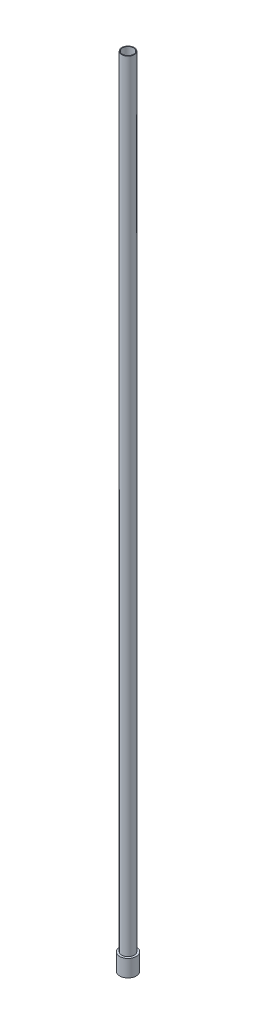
ISO-10303-21;
HEADER;
FILE_DESCRIPTION(('STEP AP214'),'2;1');
FILE_NAME('part.step','',(''),(''),'','','');
FILE_SCHEMA(('AUTOMOTIVE_DESIGN { 1 0 10303 214 1 1 1 1 }'));
ENDSEC;
DATA;
#1=APPLICATION_CONTEXT('core data for automotive mechanical design processes');
#2=APPLICATION_PROTOCOL_DEFINITION('international standard','automotive_design',2000,#1);
#3=PRODUCT_CONTEXT('',#1,'mechanical');
#4=PRODUCT('Part','Part','',(#3));
#5=PRODUCT_RELATED_PRODUCT_CATEGORY('part','',(#4));
#6=PRODUCT_DEFINITION_FORMATION('','',#4);
#7=PRODUCT_DEFINITION_CONTEXT('part definition',#1,'design');
#8=PRODUCT_DEFINITION('design','',#6,#7);
#9=PRODUCT_DEFINITION_SHAPE('','',#8);
#10=(LENGTH_UNIT() NAMED_UNIT(*) SI_UNIT(.MILLI.,.METRE.));
#11=(NAMED_UNIT(*) PLANE_ANGLE_UNIT() SI_UNIT($,.RADIAN.));
#12=(NAMED_UNIT(*) SI_UNIT($,.STERADIAN.) SOLID_ANGLE_UNIT());
#13=UNCERTAINTY_MEASURE_WITH_UNIT(LENGTH_MEASURE(1.E-05),#10,'distance_accuracy_value','');
#14=(GEOMETRIC_REPRESENTATION_CONTEXT(3) GLOBAL_UNCERTAINTY_ASSIGNED_CONTEXT((#13)) GLOBAL_UNIT_ASSIGNED_CONTEXT((#10,
#11,#12)) REPRESENTATION_CONTEXT('',''));
#15=CARTESIAN_POINT('',(0.,0.,0.));
#16=DIRECTION('',(0.,0.,1.));
#17=DIRECTION('',(1.,0.,0.));
#18=AXIS2_PLACEMENT_3D('',#15,#16,#17);
#19=CARTESIAN_POINT('',(0.,0.,0.));
#20=DIRECTION('',(0.,-1.,0.));
#21=DIRECTION('',(0.,0.,-1.));
#22=AXIS2_PLACEMENT_3D('',#19,#20,#21);
#23=CYLINDRICAL_SURFACE('',#22,2.1209);
#24=CARTESIAN_POINT('',(0.,304.8,0.));
#25=DIRECTION('',(0.,-1.,0.));
#26=DIRECTION('',(0.,0.,-1.));
#27=AXIS2_PLACEMENT_3D('',#24,#25,#26);
#28=CIRCLE('',#27,2.1209);
#29=CARTESIAN_POINT('',(0.,304.8,-2.1209));
#30=VERTEX_POINT('',#29);
#31=EDGE_CURVE('E52',#30,#30,#28,.T.);
#32=ORIENTED_EDGE('',*,*,#31,.F.);
#33=EDGE_LOOP('',(#32));
#34=FACE_BOUND('',#33,.T.);
#35=CARTESIAN_POINT('',(0.,0.,0.));
#36=DIRECTION('',(0.,-1.,0.));
#37=DIRECTION('',(0.,0.,-1.));
#38=AXIS2_PLACEMENT_3D('',#35,#36,#37);
#39=CIRCLE('',#38,2.1209);
#40=CARTESIAN_POINT('',(0.,0.,-2.1209));
#41=VERTEX_POINT('',#40);
#42=EDGE_CURVE('E10',#41,#41,#39,.T.);
#43=ORIENTED_EDGE('',*,*,#42,.T.);
#44=EDGE_LOOP('',(#43));
#45=FACE_BOUND('',#44,.T.);
#46=ADVANCED_FACE('F30',(#34,#45),#23,.F.);
#47=CARTESIAN_POINT('',(-2.1209,0.,0.));
#48=DIRECTION('',(0.,1.,0.));
#49=DIRECTION('',(0.,0.,1.));
#50=AXIS2_PLACEMENT_3D('',#47,#48,#49);
#51=PLANE('',#50);
#52=ORIENTED_EDGE('',*,*,#42,.F.);
#53=EDGE_LOOP('',(#52));
#54=FACE_BOUND('',#53,.T.);
#55=CARTESIAN_POINT('',(0.,0.,0.));
#56=DIRECTION('',(0.,-1.,0.));
#57=DIRECTION('',(0.,0.,-1.));
#58=AXIS2_PLACEMENT_3D('',#55,#56,#57);
#59=CIRCLE('',#58,3.175);
#60=CARTESIAN_POINT('',(0.,0.,-3.175));
#61=VERTEX_POINT('',#60);
#62=EDGE_CURVE('E36',#61,#61,#59,.T.);
#63=ORIENTED_EDGE('',*,*,#62,.T.);
#64=EDGE_LOOP('',(#63));
#65=FACE_BOUND('',#64,.T.);
#66=ADVANCED_FACE('F59',(#54,#65),#51,.F.);
#67=CARTESIAN_POINT('',(0.,0.,0.));
#68=DIRECTION('',(0.,-1.,0.));
#69=DIRECTION('',(0.,0.,-1.));
#70=AXIS2_PLACEMENT_3D('',#67,#68,#69);
#71=CYLINDRICAL_SURFACE('',#70,3.175);
#72=ORIENTED_EDGE('',*,*,#62,.F.);
#73=EDGE_LOOP('',(#72));
#74=FACE_BOUND('',#73,.T.);
#75=CARTESIAN_POINT('',(0.,6.477,0.));
#76=DIRECTION('',(0.,-1.,0.));
#77=DIRECTION('',(0.,0.,-1.));
#78=AXIS2_PLACEMENT_3D('',#75,#76,#77);
#79=CIRCLE('',#78,3.175);
#80=CARTESIAN_POINT('',(0.,6.477,-3.175));
#81=VERTEX_POINT('',#80);
#82=EDGE_CURVE('E40',#81,#81,#79,.T.);
#83=ORIENTED_EDGE('',*,*,#82,.T.);
#84=EDGE_LOOP('',(#83));
#85=FACE_BOUND('',#84,.T.);
#86=ADVANCED_FACE('F63',(#74,#85),#71,.T.);
#87=CARTESIAN_POINT('',(-3.175,6.477,0.));
#88=DIRECTION('',(0.,-1.,0.));
#89=DIRECTION('',(0.,0.,-1.));
#90=AXIS2_PLACEMENT_3D('',#87,#88,#89);
#91=PLANE('',#90);
#92=ORIENTED_EDGE('',*,*,#82,.F.);
#93=EDGE_LOOP('',(#92));
#94=FACE_BOUND('',#93,.T.);
#95=CARTESIAN_POINT('',(0.,6.477,0.));
#96=DIRECTION('',(0.,-1.,0.));
#97=DIRECTION('',(0.,0.,-1.));
#98=AXIS2_PLACEMENT_3D('',#95,#96,#97);
#99=CIRCLE('',#98,2.3749);
#100=CARTESIAN_POINT('',(0.,6.477,-2.3749));
#101=VERTEX_POINT('',#100);
#102=EDGE_CURVE('E44',#101,#101,#99,.T.);
#103=ORIENTED_EDGE('',*,*,#102,.T.);
#104=EDGE_LOOP('',(#103));
#105=FACE_BOUND('',#104,.T.);
#106=ADVANCED_FACE('F68',(#94,#105),#91,.F.);
#107=CARTESIAN_POINT('',(0.,0.,0.));
#108=DIRECTION('',(0.,-1.,0.));
#109=DIRECTION('',(0.,0.,-1.));
#110=AXIS2_PLACEMENT_3D('',#107,#108,#109);
#111=CYLINDRICAL_SURFACE('',#110,2.3749);
#112=ORIENTED_EDGE('',*,*,#102,.F.);
#113=EDGE_LOOP('',(#112));
#114=FACE_BOUND('',#113,.T.);
#115=CARTESIAN_POINT('',(0.,304.8,0.));
#116=DIRECTION('',(0.,-1.,0.));
#117=DIRECTION('',(0.,0.,-1.));
#118=AXIS2_PLACEMENT_3D('',#115,#116,#117);
#119=CIRCLE('',#118,2.3749);
#120=CARTESIAN_POINT('',(0.,304.8,-2.3749));
#121=VERTEX_POINT('',#120);
#122=EDGE_CURVE('E49',#121,#121,#119,.T.);
#123=ORIENTED_EDGE('',*,*,#122,.T.);
#124=EDGE_LOOP('',(#123));
#125=FACE_BOUND('',#124,.T.);
#126=ADVANCED_FACE('F74',(#114,#125),#111,.T.);
#127=CARTESIAN_POINT('',(-2.3749,304.8,0.));
#128=DIRECTION('',(0.,-1.,0.));
#129=DIRECTION('',(0.,0.,-1.));
#130=AXIS2_PLACEMENT_3D('',#127,#128,#129);
#131=PLANE('',#130);
#132=ORIENTED_EDGE('',*,*,#122,.F.);
#133=EDGE_LOOP('',(#132));
#134=FACE_BOUND('',#133,.T.);
#135=ORIENTED_EDGE('',*,*,#31,.T.);
#136=EDGE_LOOP('',(#135));
#137=FACE_BOUND('',#136,.T.);
#138=ADVANCED_FACE('F56',(#134,#137),#131,.F.);
#139=CLOSED_SHELL('',(#46,#66,#86,#106,#126,#138));
#140=MANIFOLD_SOLID_BREP('B2',#139);
#141=ADVANCED_BREP_SHAPE_REPRESENTATION('',(#18,#140),#14);
#142=SHAPE_DEFINITION_REPRESENTATION(#9,#141);
ENDSEC;
END-ISO-10303-21;
